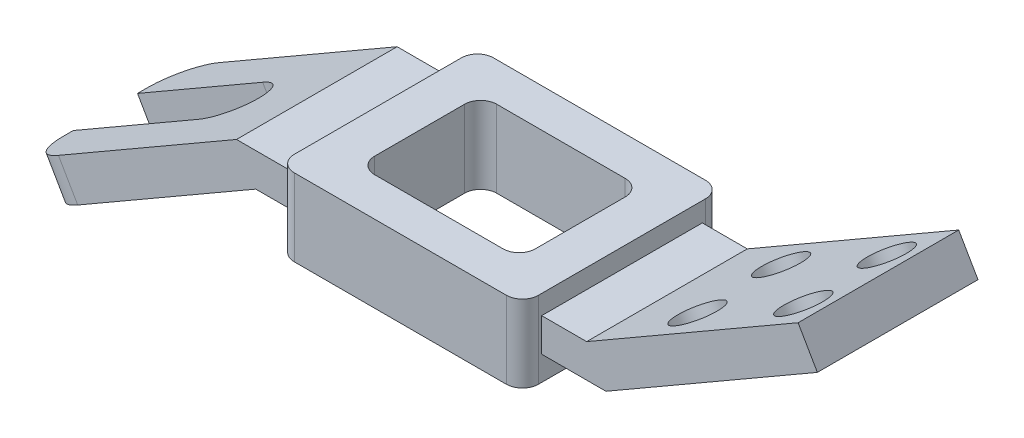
ISO-10303-21;
HEADER;
FILE_DESCRIPTION(('STEP AP214'),'2;1');
FILE_NAME('part.step','',(''),(''),'','','');
FILE_SCHEMA(('AUTOMOTIVE_DESIGN { 1 0 10303 214 1 1 1 1 }'));
ENDSEC;
DATA;
#1=APPLICATION_CONTEXT('core data for automotive mechanical design processes');
#2=APPLICATION_PROTOCOL_DEFINITION('international standard','automotive_design',2000,#1);
#3=PRODUCT_CONTEXT('',#1,'mechanical');
#4=PRODUCT('Part','Part','',(#3));
#5=PRODUCT_RELATED_PRODUCT_CATEGORY('part','',(#4));
#6=PRODUCT_DEFINITION_FORMATION('','',#4);
#7=PRODUCT_DEFINITION_CONTEXT('part definition',#1,'design');
#8=PRODUCT_DEFINITION('design','',#6,#7);
#9=PRODUCT_DEFINITION_SHAPE('','',#8);
#10=(LENGTH_UNIT() NAMED_UNIT(*) SI_UNIT(.MILLI.,.METRE.));
#11=(NAMED_UNIT(*) PLANE_ANGLE_UNIT() SI_UNIT($,.RADIAN.));
#12=(NAMED_UNIT(*) SI_UNIT($,.STERADIAN.) SOLID_ANGLE_UNIT());
#13=UNCERTAINTY_MEASURE_WITH_UNIT(LENGTH_MEASURE(1.E-05),#10,'distance_accuracy_value','');
#14=(GEOMETRIC_REPRESENTATION_CONTEXT(3) GLOBAL_UNCERTAINTY_ASSIGNED_CONTEXT((#13)) GLOBAL_UNIT_ASSIGNED_CONTEXT((#10,
#11,#12)) REPRESENTATION_CONTEXT('',''));
#15=CARTESIAN_POINT('',(0.,0.,0.));
#16=DIRECTION('',(0.,0.,1.));
#17=DIRECTION('',(1.,0.,0.));
#18=AXIS2_PLACEMENT_3D('',#15,#16,#17);
#19=CARTESIAN_POINT('',(-116.817930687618,-48.3923048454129,50.));
#20=DIRECTION('',(0.866025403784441,0.499999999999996,0.));
#21=DIRECTION('',(-0.499999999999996,0.866025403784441,0.));
#22=AXIS2_PLACEMENT_3D('',#19,#20,#21);
#23=PLANE('',#22);
#24=DIRECTION('',(0.,0.,-1.));
#25=VECTOR('',#24,1.);
#26=CARTESIAN_POINT('',(-116.817930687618,-48.3923048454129,50.));
#27=LINE('',#26,#25);
#28=CARTESIAN_POINT('',(-116.817930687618,-48.3923048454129,38.));
#29=VERTEX_POINT('',#28);
#30=CARTESIAN_POINT('',(-116.817930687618,-48.3923048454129,35.));
#31=VERTEX_POINT('',#30);
#32=EDGE_CURVE('E311',#29,#31,#27,.T.);
#33=ORIENTED_EDGE('',*,*,#32,.F.);
#34=DIRECTION('',(0.499999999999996,-0.866025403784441,0.));
#35=VECTOR('',#34,1.);
#36=CARTESIAN_POINT('',(-116.817930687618,-48.3923048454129,38.));
#37=LINE('',#36,#35);
#38=CARTESIAN_POINT('',(-122.817930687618,-37.9999999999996,38.));
#39=VERTEX_POINT('',#38);
#40=EDGE_CURVE('E333',#29,#39,#37,.F.);
#41=ORIENTED_EDGE('',*,*,#40,.T.);
#42=DIRECTION('',(0.,0.,-1.));
#43=VECTOR('',#42,1.);
#44=CARTESIAN_POINT('',(-122.817930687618,-37.9999999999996,50.));
#45=LINE('',#44,#43);
#46=CARTESIAN_POINT('',(-122.817930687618,-37.9999999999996,35.));
#47=VERTEX_POINT('',#46);
#48=EDGE_CURVE('E283',#39,#47,#45,.T.);
#49=ORIENTED_EDGE('',*,*,#48,.T.);
#50=DIRECTION('',(-0.499999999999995,0.866025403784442,0.));
#51=VECTOR('',#50,1.);
#52=CARTESIAN_POINT('',(-56.6589653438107,-152.590689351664,35.));
#53=LINE('',#52,#51);
#54=EDGE_CURVE('E277',#31,#47,#53,.T.);
#55=ORIENTED_EDGE('',*,*,#54,.F.);
#56=EDGE_LOOP('',(#33,#41,#49,#55));
#57=FACE_BOUND('',#56,.T.);
#58=ADVANCED_FACE('F33',(#57),#23,.F.);
#59=CARTESIAN_POINT('',(58.,-10.3923048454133,50.));
#60=DIRECTION('',(0.,1.,0.));
#61=DIRECTION('',(0.,0.,1.));
#62=AXIS2_PLACEMENT_3D('',#59,#60,#61);
#63=PLANE('',#62);
#64=DIRECTION('',(1.,0.,0.));
#65=VECTOR('',#64,1.);
#66=CARTESIAN_POINT('',(58.,-10.3923048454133,0.));
#67=LINE('',#66,#65);
#68=CARTESIAN_POINT('',(-51.0000000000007,-10.3923048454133,0.));
#69=VERTEX_POINT('',#68);
#70=CARTESIAN_POINT('',(-38.0000000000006,-10.3923048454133,0.));
#71=VERTEX_POINT('',#70);
#72=EDGE_CURVE('E498',#69,#71,#67,.T.);
#73=ORIENTED_EDGE('',*,*,#72,.T.);
#74=DIRECTION('',(0.,0.,1.));
#75=VECTOR('',#74,1.);
#76=CARTESIAN_POINT('',(-38.0000000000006,-10.3923048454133,50.));
#77=LINE('',#76,#75);
#78=CARTESIAN_POINT('',(-38.0000000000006,-10.3923048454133,50.));
#79=VERTEX_POINT('',#78);
#80=EDGE_CURVE('E476',#71,#79,#77,.T.);
#81=ORIENTED_EDGE('',*,*,#80,.T.);
#82=DIRECTION('',(1.,0.,0.));
#83=VECTOR('',#82,1.);
#84=CARTESIAN_POINT('',(-38.0000000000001,-10.3923048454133,50.));
#85=LINE('',#84,#83);
#86=CARTESIAN_POINT('',(-51.0000000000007,-10.3923048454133,50.));
#87=VERTEX_POINT('',#86);
#88=EDGE_CURVE('E484',#87,#79,#85,.T.);
#89=ORIENTED_EDGE('',*,*,#88,.F.);
#90=DIRECTION('',(0.,0.,-1.));
#91=VECTOR('',#90,1.);
#92=CARTESIAN_POINT('',(-51.0000000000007,-10.3923048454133,50.));
#93=LINE('',#92,#91);
#94=EDGE_CURVE('E308',#87,#69,#93,.T.);
#95=ORIENTED_EDGE('',*,*,#94,.T.);
#96=EDGE_LOOP('',(#73,#81,#89,#95));
#97=FACE_BOUND('',#96,.T.);
#98=ADVANCED_FACE('F572',(#97),#63,.F.);
#99=CARTESIAN_POINT('',(-57.0000000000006,0.,50.));
#100=DIRECTION('',(0.,-1.,0.));
#101=DIRECTION('',(1.,0.,0.));
#102=AXIS2_PLACEMENT_3D('',#99,#100,#101);
#103=PLANE('',#102);
#104=DIRECTION('',(-1.,0.,0.));
#105=VECTOR('',#104,1.);
#106=CARTESIAN_POINT('',(38.,0.,50.));
#107=LINE('',#106,#105);
#108=CARTESIAN_POINT('',(-38.0000000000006,0.,50.));
#109=VERTEX_POINT('',#108);
#110=CARTESIAN_POINT('',(-57.0000000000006,0.,50.));
#111=VERTEX_POINT('',#110);
#112=EDGE_CURVE('E493',#109,#111,#107,.T.);
#113=ORIENTED_EDGE('',*,*,#112,.F.);
#114=DIRECTION('',(0.,0.,-1.));
#115=VECTOR('',#114,1.);
#116=CARTESIAN_POINT('',(-38.0000000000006,0.,50.));
#117=LINE('',#116,#115);
#118=CARTESIAN_POINT('',(-38.0000000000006,0.,0.));
#119=VERTEX_POINT('',#118);
#120=EDGE_CURVE('E473',#109,#119,#117,.T.);
#121=ORIENTED_EDGE('',*,*,#120,.T.);
#122=DIRECTION('',(-1.,0.,0.));
#123=VECTOR('',#122,1.);
#124=CARTESIAN_POINT('',(-57.0000000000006,0.,0.));
#125=LINE('',#124,#123);
#126=CARTESIAN_POINT('',(-57.0000000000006,0.,0.));
#127=VERTEX_POINT('',#126);
#128=EDGE_CURVE('E507',#119,#127,#125,.T.);
#129=ORIENTED_EDGE('',*,*,#128,.T.);
#130=DIRECTION('',(0.,0.,-1.));
#131=VECTOR('',#130,1.);
#132=CARTESIAN_POINT('',(-57.0000000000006,0.,50.));
#133=LINE('',#132,#131);
#134=EDGE_CURVE('E286',#111,#127,#133,.T.);
#135=ORIENTED_EDGE('',*,*,#134,.F.);
#136=EDGE_LOOP('',(#113,#121,#129,#135));
#137=FACE_BOUND('',#136,.T.);
#138=ADVANCED_FACE('F515',(#137),#103,.F.);
#139=CARTESIAN_POINT('',(0.,0.,50.));
#140=DIRECTION('',(0.,0.,-1.));
#141=DIRECTION('',(-1.,0.,0.));
#142=AXIS2_PLACEMENT_3D('',#139,#140,#141);
#143=PLANE('',#142);
#144=DIRECTION('',(-0.866025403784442,-0.499999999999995,0.));
#145=VECTOR('',#144,1.);
#146=CARTESIAN_POINT('',(-122.817930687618,-37.9999999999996,50.));
#147=LINE('',#146,#145);
#148=CARTESIAN_POINT('',(-112.425625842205,-31.9999999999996,50.));
#149=VERTEX_POINT('',#148);
#150=EDGE_CURVE('E284',#111,#149,#147,.T.);
#151=ORIENTED_EDGE('',*,*,#150,.T.);
#152=DIRECTION('',(0.499999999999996,-0.866025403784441,0.));
#153=VECTOR('',#152,1.);
#154=CARTESIAN_POINT('',(-98.1756258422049,-56.6817240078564,50.));
#155=LINE('',#154,#153);
#156=CARTESIAN_POINT('',(-106.425625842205,-42.3923048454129,50.));
#157=VERTEX_POINT('',#156);
#158=EDGE_CURVE('E330',#149,#157,#155,.T.);
#159=ORIENTED_EDGE('',*,*,#158,.T.);
#160=DIRECTION('',(0.866025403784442,0.499999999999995,0.));
#161=VECTOR('',#160,1.);
#162=CARTESIAN_POINT('',(-51.0000000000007,-10.3923048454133,50.));
#163=LINE('',#162,#161);
#164=EDGE_CURVE('E481',#157,#87,#163,.T.);
#165=ORIENTED_EDGE('',*,*,#164,.T.);
#166=ORIENTED_EDGE('',*,*,#88,.T.);
#167=DIRECTION('',(0.,1.,0.));
#168=VECTOR('',#167,1.);
#169=CARTESIAN_POINT('',(-38.0000000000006,0.,50.));
#170=LINE('',#169,#168);
#171=EDGE_CURVE('E478',#79,#109,#170,.T.);
#172=ORIENTED_EDGE('',*,*,#171,.T.);
#173=ORIENTED_EDGE('',*,*,#112,.T.);
#174=EDGE_LOOP('',(#151,#159,#165,#166,#172,#173));
#175=FACE_BOUND('',#174,.T.);
#176=ADVANCED_FACE('F589',(#175),#143,.F.);
#177=CARTESIAN_POINT('',(0.,0.,0.));
#178=DIRECTION('',(0.,0.,-1.));
#179=DIRECTION('',(-1.,0.,0.));
#180=AXIS2_PLACEMENT_3D('',#177,#178,#179);
#181=PLANE('',#180);
#182=DIRECTION('',(0.866025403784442,0.499999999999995,0.));
#183=VECTOR('',#182,1.);
#184=CARTESIAN_POINT('',(-51.0000000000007,-10.3923048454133,0.));
#185=LINE('',#184,#183);
#186=CARTESIAN_POINT('',(-106.425625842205,-42.3923048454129,0.));
#187=VERTEX_POINT('',#186);
#188=EDGE_CURVE('E480',#187,#69,#185,.T.);
#189=ORIENTED_EDGE('',*,*,#188,.F.);
#190=DIRECTION('',(0.499999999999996,-0.866025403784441,0.));
#191=VECTOR('',#190,1.);
#192=CARTESIAN_POINT('',(-112.425625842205,-31.9999999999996,0.));
#193=LINE('',#192,#191);
#194=CARTESIAN_POINT('',(-112.425625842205,-31.9999999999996,0.));
#195=VERTEX_POINT('',#194);
#196=EDGE_CURVE('E325',#187,#195,#193,.F.);
#197=ORIENTED_EDGE('',*,*,#196,.T.);
#198=DIRECTION('',(-0.866025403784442,-0.499999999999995,0.));
#199=VECTOR('',#198,1.);
#200=CARTESIAN_POINT('',(-122.817930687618,-37.9999999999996,0.));
#201=LINE('',#200,#199);
#202=EDGE_CURVE('E292',#127,#195,#201,.T.);
#203=ORIENTED_EDGE('',*,*,#202,.F.);
#204=ORIENTED_EDGE('',*,*,#128,.F.);
#205=DIRECTION('',(0.,1.,0.));
#206=VECTOR('',#205,1.);
#207=CARTESIAN_POINT('',(-38.0000000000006,0.,0.));
#208=LINE('',#207,#206);
#209=EDGE_CURVE('E316',#71,#119,#208,.T.);
#210=ORIENTED_EDGE('',*,*,#209,.F.);
#211=ORIENTED_EDGE('',*,*,#72,.F.);
#212=EDGE_LOOP('',(#189,#197,#203,#204,#210,#211));
#213=FACE_BOUND('',#212,.T.);
#214=ADVANCED_FACE('F521',(#213),#181,.T.);
#215=CARTESIAN_POINT('',(-122.817930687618,-37.9999999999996,15.));
#216=VERTEX_POINT('',#215);
#217=CARTESIAN_POINT('',(-122.817930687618,-37.9999999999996,12.));
#218=VERTEX_POINT('',#217);
#219=EDGE_CURVE('E273',#216,#218,#45,.T.);
#220=ORIENTED_EDGE('',*,*,#219,.T.);
#221=DIRECTION('',(0.499999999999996,-0.866025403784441,0.));
#222=VECTOR('',#221,1.);
#223=CARTESIAN_POINT('',(-116.817930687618,-48.3923048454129,12.));
#224=LINE('',#223,#222);
#225=CARTESIAN_POINT('',(-116.817930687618,-48.3923048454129,12.));
#226=VERTEX_POINT('',#225);
#227=EDGE_CURVE('E319',#218,#226,#224,.T.);
#228=ORIENTED_EDGE('',*,*,#227,.T.);
#229=CARTESIAN_POINT('',(-116.817930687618,-48.3923048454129,15.));
#230=VERTEX_POINT('',#229);
#231=EDGE_CURVE('E276',#230,#226,#27,.T.);
#232=ORIENTED_EDGE('',*,*,#231,.F.);
#233=DIRECTION('',(-0.499999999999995,0.866025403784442,0.));
#234=VECTOR('',#233,1.);
#235=CARTESIAN_POINT('',(-56.6589653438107,-152.590689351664,15.));
#236=LINE('',#235,#234);
#237=EDGE_CURVE('E258',#230,#216,#236,.T.);
#238=ORIENTED_EDGE('',*,*,#237,.T.);
#239=EDGE_LOOP('',(#220,#228,#232,#238));
#240=FACE_BOUND('',#239,.T.);
#241=ADVANCED_FACE('F271',(#240),#23,.F.);
#242=CARTESIAN_POINT('',(-51.0000000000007,-10.3923048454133,50.));
#243=DIRECTION('',(-0.499999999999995,0.866025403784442,0.));
#244=DIRECTION('',(-0.866025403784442,-0.499999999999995,0.));
#245=AXIS2_PLACEMENT_3D('',#242,#243,#244);
#246=PLANE('',#245);
#247=ORIENTED_EDGE('',*,*,#231,.T.);
#248=CARTESIAN_POINT('',(-106.425625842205,-42.3923048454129,12.));
#249=DIRECTION('',(-0.499999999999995,0.866025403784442,0.));
#250=DIRECTION('',(-0.866025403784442,-0.499999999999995,0.));
#251=AXIS2_PLACEMENT_3D('',#248,#249,#250);
#252=CIRCLE('',#251,12.);
#253=EDGE_CURVE('E323',#226,#187,#252,.F.);
#254=ORIENTED_EDGE('',*,*,#253,.T.);
#255=ORIENTED_EDGE('',*,*,#188,.T.);
#256=ORIENTED_EDGE('',*,*,#94,.F.);
#257=ORIENTED_EDGE('',*,*,#164,.F.);
#258=CARTESIAN_POINT('',(-106.425625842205,-42.3923048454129,38.));
#259=DIRECTION('',(-0.499999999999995,0.866025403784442,0.));
#260=DIRECTION('',(-0.866025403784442,-0.499999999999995,0.));
#261=AXIS2_PLACEMENT_3D('',#258,#259,#260);
#262=CIRCLE('',#261,12.);
#263=EDGE_CURVE('E321',#157,#29,#262,.F.);
#264=ORIENTED_EDGE('',*,*,#263,.T.);
#265=ORIENTED_EDGE('',*,*,#32,.T.);
#266=DIRECTION('',(0.866025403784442,0.499999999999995,0.));
#267=VECTOR('',#266,1.);
#268=CARTESIAN_POINT('',(-51.0000000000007,-10.3923048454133,35.));
#269=LINE('',#268,#267);
#270=CARTESIAN_POINT('',(-77.8467875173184,-25.8923048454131,35.));
#271=VERTEX_POINT('',#270);
#272=EDGE_CURVE('E532',#31,#271,#269,.T.);
#273=ORIENTED_EDGE('',*,*,#272,.T.);
#274=CARTESIAN_POINT('',(-77.8467875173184,-25.8923048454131,25.));
#275=DIRECTION('',(-0.499999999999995,0.866025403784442,0.));
#276=DIRECTION('',(-0.866025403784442,-0.499999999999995,0.));
#277=AXIS2_PLACEMENT_3D('',#274,#275,#276);
#278=CIRCLE('',#277,9.99999999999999);
#279=CARTESIAN_POINT('',(-77.8467875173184,-25.8923048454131,15.));
#280=VERTEX_POINT('',#279);
#281=EDGE_CURVE('E531',#271,#280,#278,.T.);
#282=ORIENTED_EDGE('',*,*,#281,.T.);
#283=DIRECTION('',(-0.866025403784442,-0.499999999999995,0.));
#284=VECTOR('',#283,1.);
#285=CARTESIAN_POINT('',(-51.0000000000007,-10.3923048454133,15.));
#286=LINE('',#285,#284);
#287=EDGE_CURVE('E529',#280,#230,#286,.T.);
#288=ORIENTED_EDGE('',*,*,#287,.T.);
#289=EDGE_LOOP('',(#247,#254,#255,#256,#257,#264,#265,#273,#282,#288));
#290=FACE_BOUND('',#289,.T.);
#291=ADVANCED_FACE('F527',(#290),#246,.F.);
#292=CARTESIAN_POINT('',(-122.817930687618,-37.9999999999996,50.));
#293=DIRECTION('',(0.499999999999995,-0.866025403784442,0.));
#294=DIRECTION('',(0.866025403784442,0.499999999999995,0.));
#295=AXIS2_PLACEMENT_3D('',#292,#293,#294);
#296=PLANE('',#295);
#297=ORIENTED_EDGE('',*,*,#202,.T.);
#298=CARTESIAN_POINT('',(-112.425625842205,-31.9999999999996,12.));
#299=DIRECTION('',(0.499999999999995,-0.866025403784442,0.));
#300=DIRECTION('',(0.866025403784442,0.499999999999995,0.));
#301=AXIS2_PLACEMENT_3D('',#298,#299,#300);
#302=CIRCLE('',#301,12.);
#303=EDGE_CURVE('E282',#195,#218,#302,.F.);
#304=ORIENTED_EDGE('',*,*,#303,.T.);
#305=ORIENTED_EDGE('',*,*,#219,.F.);
#306=DIRECTION('',(-0.866025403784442,-0.499999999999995,0.));
#307=VECTOR('',#306,1.);
#308=CARTESIAN_POINT('',(-83.8467875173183,-15.4999999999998,15.));
#309=LINE('',#308,#307);
#310=CARTESIAN_POINT('',(-83.8467875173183,-15.4999999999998,15.));
#311=VERTEX_POINT('',#310);
#312=EDGE_CURVE('E255',#311,#216,#309,.T.);
#313=ORIENTED_EDGE('',*,*,#312,.F.);
#314=CARTESIAN_POINT('',(-83.8467875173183,-15.4999999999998,25.));
#315=DIRECTION('',(-0.499999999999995,0.866025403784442,0.));
#316=DIRECTION('',(-0.866025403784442,-0.499999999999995,0.));
#317=AXIS2_PLACEMENT_3D('',#314,#315,#316);
#318=CIRCLE('',#317,9.99999999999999);
#319=CARTESIAN_POINT('',(-83.8467875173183,-15.4999999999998,35.));
#320=VERTEX_POINT('',#319);
#321=EDGE_CURVE('E266',#320,#311,#318,.T.);
#322=ORIENTED_EDGE('',*,*,#321,.F.);
#323=DIRECTION('',(0.866025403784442,0.499999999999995,0.));
#324=VECTOR('',#323,1.);
#325=CARTESIAN_POINT('',(-83.8467875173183,-15.4999999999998,35.));
#326=LINE('',#325,#324);
#327=EDGE_CURVE('E265',#47,#320,#326,.T.);
#328=ORIENTED_EDGE('',*,*,#327,.F.);
#329=ORIENTED_EDGE('',*,*,#48,.F.);
#330=CARTESIAN_POINT('',(-112.425625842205,-31.9999999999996,38.));
#331=DIRECTION('',(0.499999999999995,-0.866025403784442,0.));
#332=DIRECTION('',(0.866025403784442,0.499999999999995,0.));
#333=AXIS2_PLACEMENT_3D('',#330,#331,#332);
#334=CIRCLE('',#333,12.);
#335=EDGE_CURVE('E327',#39,#149,#334,.F.);
#336=ORIENTED_EDGE('',*,*,#335,.T.);
#337=ORIENTED_EDGE('',*,*,#150,.F.);
#338=ORIENTED_EDGE('',*,*,#134,.T.);
#339=EDGE_LOOP('',(#297,#304,#305,#313,#322,#328,#329,#336,#337,#338));
#340=FACE_BOUND('',#339,.T.);
#341=ADVANCED_FACE('F280',(#340),#296,.F.);
#342=CARTESIAN_POINT('',(-38.0000000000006,-18.,-6.));
#343=DIRECTION('',(-1.,0.,0.));
#344=DIRECTION('',(0.,-1.,0.));
#345=AXIS2_PLACEMENT_3D('',#342,#343,#344);
#346=PLANE('',#345);
#347=DIRECTION('',(0.,0.,1.));
#348=VECTOR('',#347,1.);
#349=CARTESIAN_POINT('',(-38.0000000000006,6.00000000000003,-6.));
#350=LINE('',#349,#348);
#351=CARTESIAN_POINT('',(-38.0000000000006,6.00000000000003,-0.999999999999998));
#352=VERTEX_POINT('',#351);
#353=CARTESIAN_POINT('',(-38.0000000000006,6.00000000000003,51.));
#354=VERTEX_POINT('',#353);
#355=EDGE_CURVE('E443',#352,#354,#350,.T.);
#356=ORIENTED_EDGE('',*,*,#355,.F.);
#357=DIRECTION('',(0.,1.,0.));
#358=VECTOR('',#357,1.);
#359=CARTESIAN_POINT('',(-38.0000000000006,-18.,-0.999999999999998));
#360=LINE('',#359,#358);
#361=CARTESIAN_POINT('',(-38.0000000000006,-18.,-0.999999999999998));
#362=VERTEX_POINT('',#361);
#363=EDGE_CURVE('E383',#352,#362,#360,.F.);
#364=ORIENTED_EDGE('',*,*,#363,.T.);
#365=DIRECTION('',(0.,0.,1.));
#366=VECTOR('',#365,1.);
#367=CARTESIAN_POINT('',(-38.0000000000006,-18.,-6.));
#368=LINE('',#367,#366);
#369=CARTESIAN_POINT('',(-38.0000000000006,-18.,51.));
#370=VERTEX_POINT('',#369);
#371=EDGE_CURVE('E455',#362,#370,#368,.T.);
#372=ORIENTED_EDGE('',*,*,#371,.T.);
#373=DIRECTION('',(0.,1.,0.));
#374=VECTOR('',#373,1.);
#375=CARTESIAN_POINT('',(-38.0000000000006,-18.,51.));
#376=LINE('',#375,#374);
#377=EDGE_CURVE('E380',#370,#354,#376,.T.);
#378=ORIENTED_EDGE('',*,*,#377,.T.);
#379=EDGE_LOOP('',(#356,#364,#372,#378));
#380=FACE_BOUND('',#379,.T.);
#381=ORIENTED_EDGE('',*,*,#171,.F.);
#382=ORIENTED_EDGE('',*,*,#80,.F.);
#383=ORIENTED_EDGE('',*,*,#209,.T.);
#384=ORIENTED_EDGE('',*,*,#120,.F.);
#385=EDGE_LOOP('',(#381,#382,#383,#384));
#386=FACE_BOUND('',#385,.T.);
#387=ADVANCED_FACE('F645',(#380,#386),#346,.T.);
#388=CARTESIAN_POINT('',(37.9999999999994,-18.,-6.));
#389=DIRECTION('',(1.,0.,0.));
#390=DIRECTION('',(0.,1.,0.));
#391=AXIS2_PLACEMENT_3D('',#388,#389,#390);
#392=PLANE('',#391);
#393=DIRECTION('',(0.,0.,-1.));
#394=VECTOR('',#393,1.);
#395=CARTESIAN_POINT('',(37.9999999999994,-18.,-6.));
#396=LINE('',#395,#394);
#397=CARTESIAN_POINT('',(37.9999999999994,-18.,51.));
#398=VERTEX_POINT('',#397);
#399=CARTESIAN_POINT('',(37.9999999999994,-18.,-1.));
#400=VERTEX_POINT('',#399);
#401=EDGE_CURVE('E460',#398,#400,#396,.T.);
#402=ORIENTED_EDGE('',*,*,#401,.T.);
#403=DIRECTION('',(0.,1.,0.));
#404=VECTOR('',#403,1.);
#405=CARTESIAN_POINT('',(37.9999999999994,-18.,-1.));
#406=LINE('',#405,#404);
#407=CARTESIAN_POINT('',(37.9999999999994,5.99999999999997,-1.));
#408=VERTEX_POINT('',#407);
#409=EDGE_CURVE('E357',#400,#408,#406,.T.);
#410=ORIENTED_EDGE('',*,*,#409,.T.);
#411=DIRECTION('',(0.,0.,-1.));
#412=VECTOR('',#411,1.);
#413=CARTESIAN_POINT('',(37.9999999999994,5.99999999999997,-6.));
#414=LINE('',#413,#412);
#415=CARTESIAN_POINT('',(37.9999999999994,5.99999999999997,51.));
#416=VERTEX_POINT('',#415);
#417=EDGE_CURVE('E449',#416,#408,#414,.T.);
#418=ORIENTED_EDGE('',*,*,#417,.F.);
#419=DIRECTION('',(0.,1.,0.));
#420=VECTOR('',#419,1.);
#421=CARTESIAN_POINT('',(37.9999999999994,-18.,51.));
#422=LINE('',#421,#420);
#423=EDGE_CURVE('E355',#416,#398,#422,.F.);
#424=ORIENTED_EDGE('',*,*,#423,.T.);
#425=EDGE_LOOP('',(#402,#410,#418,#424));
#426=FACE_BOUND('',#425,.T.);
#427=DIRECTION('',(0.,-1.,0.));
#428=VECTOR('',#427,1.);
#429=CARTESIAN_POINT('',(37.9999999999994,0.,50.));
#430=LINE('',#429,#428);
#431=CARTESIAN_POINT('',(37.9999999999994,0.,50.));
#432=VERTEX_POINT('',#431);
#433=CARTESIAN_POINT('',(37.9999999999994,-10.3923048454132,50.));
#434=VERTEX_POINT('',#433);
#435=EDGE_CURVE('E471',#432,#434,#430,.T.);
#436=ORIENTED_EDGE('',*,*,#435,.F.);
#437=DIRECTION('',(0.,0.,1.));
#438=VECTOR('',#437,1.);
#439=CARTESIAN_POINT('',(37.9999999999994,0.,50.));
#440=LINE('',#439,#438);
#441=CARTESIAN_POINT('',(37.9999999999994,0.,0.));
#442=VERTEX_POINT('',#441);
#443=EDGE_CURVE('E466',#442,#432,#440,.T.);
#444=ORIENTED_EDGE('',*,*,#443,.F.);
#445=DIRECTION('',(0.,-1.,0.));
#446=VECTOR('',#445,1.);
#447=CARTESIAN_POINT('',(37.9999999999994,0.,0.));
#448=LINE('',#447,#446);
#449=CARTESIAN_POINT('',(37.9999999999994,-10.3923048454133,0.));
#450=VERTEX_POINT('',#449);
#451=EDGE_CURVE('E313',#442,#450,#448,.T.);
#452=ORIENTED_EDGE('',*,*,#451,.T.);
#453=DIRECTION('',(0.,0.,-1.));
#454=VECTOR('',#453,1.);
#455=CARTESIAN_POINT('',(37.9999999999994,-10.3923048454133,50.));
#456=LINE('',#455,#454);
#457=EDGE_CURVE('E468',#434,#450,#456,.T.);
#458=ORIENTED_EDGE('',*,*,#457,.F.);
#459=EDGE_LOOP('',(#436,#444,#452,#458));
#460=FACE_BOUND('',#459,.T.);
#461=ADVANCED_FACE('F614',(#426,#460),#392,.T.);
#462=CARTESIAN_POINT('',(-38.0000000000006,-18.,-6.));
#463=DIRECTION('',(0.,0.,-1.));
#464=DIRECTION('',(-1.,0.,0.));
#465=AXIS2_PLACEMENT_3D('',#462,#463,#464);
#466=PLANE('',#465);
#467=DIRECTION('',(-1.,0.,0.));
#468=VECTOR('',#467,1.);
#469=CARTESIAN_POINT('',(-38.0000000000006,6.00000000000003,-6.));
#470=LINE('',#469,#468);
#471=CARTESIAN_POINT('',(32.9999999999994,5.99999999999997,-6.));
#472=VERTEX_POINT('',#471);
#473=CARTESIAN_POINT('',(-33.0000000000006,6.00000000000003,-6.));
#474=VERTEX_POINT('',#473);
#475=EDGE_CURVE('E452',#472,#474,#470,.T.);
#476=ORIENTED_EDGE('',*,*,#475,.F.);
#477=DIRECTION('',(0.,1.,0.));
#478=VECTOR('',#477,1.);
#479=CARTESIAN_POINT('',(32.9999999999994,-18.,-6.));
#480=LINE('',#479,#478);
#481=CARTESIAN_POINT('',(32.9999999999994,-18.,-6.));
#482=VERTEX_POINT('',#481);
#483=EDGE_CURVE('E371',#472,#482,#480,.F.);
#484=ORIENTED_EDGE('',*,*,#483,.T.);
#485=DIRECTION('',(-1.,0.,0.));
#486=VECTOR('',#485,1.);
#487=CARTESIAN_POINT('',(-38.0000000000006,-18.,-6.));
#488=LINE('',#487,#486);
#489=CARTESIAN_POINT('',(-33.0000000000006,-18.,-6.));
#490=VERTEX_POINT('',#489);
#491=EDGE_CURVE('E463',#482,#490,#488,.T.);
#492=ORIENTED_EDGE('',*,*,#491,.T.);
#493=DIRECTION('',(0.,1.,0.));
#494=VECTOR('',#493,1.);
#495=CARTESIAN_POINT('',(-33.0000000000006,-18.,-6.));
#496=LINE('',#495,#494);
#497=EDGE_CURVE('E368',#490,#474,#496,.T.);
#498=ORIENTED_EDGE('',*,*,#497,.T.);
#499=EDGE_LOOP('',(#476,#484,#492,#498));
#500=FACE_BOUND('',#499,.T.);
#501=ADVANCED_FACE('F654',(#500),#466,.T.);
#502=CARTESIAN_POINT('',(-38.0000000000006,-18.,56.));
#503=DIRECTION('',(0.,0.,1.));
#504=DIRECTION('',(1.,0.,0.));
#505=AXIS2_PLACEMENT_3D('',#502,#503,#504);
#506=PLANE('',#505);
#507=DIRECTION('',(1.,0.,0.));
#508=VECTOR('',#507,1.);
#509=CARTESIAN_POINT('',(-38.0000000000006,-18.,56.));
#510=LINE('',#509,#508);
#511=CARTESIAN_POINT('',(-33.0000000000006,-18.,56.));
#512=VERTEX_POINT('',#511);
#513=CARTESIAN_POINT('',(32.9999999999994,-18.,56.));
#514=VERTEX_POINT('',#513);
#515=EDGE_CURVE('E458',#512,#514,#510,.T.);
#516=ORIENTED_EDGE('',*,*,#515,.T.);
#517=DIRECTION('',(0.,1.,0.));
#518=VECTOR('',#517,1.);
#519=CARTESIAN_POINT('',(32.9999999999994,-18.,56.));
#520=LINE('',#519,#518);
#521=CARTESIAN_POINT('',(32.9999999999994,5.99999999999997,56.));
#522=VERTEX_POINT('',#521);
#523=EDGE_CURVE('E386',#514,#522,#520,.T.);
#524=ORIENTED_EDGE('',*,*,#523,.T.);
#525=DIRECTION('',(1.,0.,0.));
#526=VECTOR('',#525,1.);
#527=CARTESIAN_POINT('',(-38.0000000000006,6.00000000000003,56.));
#528=LINE('',#527,#526);
#529=CARTESIAN_POINT('',(-33.0000000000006,6.00000000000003,56.));
#530=VERTEX_POINT('',#529);
#531=EDGE_CURVE('E446',#530,#522,#528,.T.);
#532=ORIENTED_EDGE('',*,*,#531,.F.);
#533=DIRECTION('',(0.,1.,0.));
#534=VECTOR('',#533,1.);
#535=CARTESIAN_POINT('',(-33.0000000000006,-18.,56.));
#536=LINE('',#535,#534);
#537=EDGE_CURVE('E55',#530,#512,#536,.F.);
#538=ORIENTED_EDGE('',*,*,#537,.T.);
#539=EDGE_LOOP('',(#516,#524,#532,#538));
#540=FACE_BOUND('',#539,.T.);
#541=ADVANCED_FACE('F660',(#540),#506,.T.);
#542=CARTESIAN_POINT('',(0.,-18.,0.));
#543=DIRECTION('',(0.,1.,0.));
#544=DIRECTION('',(-1.,0.,0.));
#545=AXIS2_PLACEMENT_3D('',#542,#543,#544);
#546=PLANE('',#545);
#547=DIRECTION('',(0.,0.,-1.));
#548=VECTOR('',#547,1.);
#549=CARTESIAN_POINT('',(24.9999999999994,-18.,0.));
#550=LINE('',#549,#548);
#551=CARTESIAN_POINT('',(24.9999999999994,-18.,39.));
#552=VERTEX_POINT('',#551);
#553=CARTESIAN_POINT('',(24.9999999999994,-18.,11.));
#554=VERTEX_POINT('',#553);
#555=EDGE_CURVE('E426',#552,#554,#550,.T.);
#556=ORIENTED_EDGE('',*,*,#555,.T.);
#557=CARTESIAN_POINT('',(19.9999999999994,-18.,11.));
#558=DIRECTION('',(0.,1.,0.));
#559=DIRECTION('',(-1.,0.,0.));
#560=AXIS2_PLACEMENT_3D('',#557,#558,#559);
#561=CIRCLE('',#560,5.);
#562=CARTESIAN_POINT('',(19.9999999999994,-18.,6.));
#563=VERTEX_POINT('',#562);
#564=EDGE_CURVE('E399',#554,#563,#561,.T.);
#565=ORIENTED_EDGE('',*,*,#564,.T.);
#566=DIRECTION('',(-1.,0.,0.));
#567=VECTOR('',#566,1.);
#568=CARTESIAN_POINT('',(0.,-18.,6.));
#569=LINE('',#568,#567);
#570=CARTESIAN_POINT('',(-20.0000000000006,-18.,6.));
#571=VERTEX_POINT('',#570);
#572=EDGE_CURVE('E432',#563,#571,#569,.T.);
#573=ORIENTED_EDGE('',*,*,#572,.T.);
#574=CARTESIAN_POINT('',(-20.0000000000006,-18.,11.));
#575=DIRECTION('',(0.,1.,0.));
#576=DIRECTION('',(-1.,0.,0.));
#577=AXIS2_PLACEMENT_3D('',#574,#575,#576);
#578=CIRCLE('',#577,5.);
#579=CARTESIAN_POINT('',(-25.0000000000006,-18.,11.));
#580=VERTEX_POINT('',#579);
#581=EDGE_CURVE('E391',#571,#580,#578,.T.);
#582=ORIENTED_EDGE('',*,*,#581,.T.);
#583=DIRECTION('',(0.,0.,1.));
#584=VECTOR('',#583,1.);
#585=CARTESIAN_POINT('',(-25.0000000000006,-18.,0.));
#586=LINE('',#585,#584);
#587=CARTESIAN_POINT('',(-25.0000000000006,-18.,39.));
#588=VERTEX_POINT('',#587);
#589=EDGE_CURVE('E435',#580,#588,#586,.T.);
#590=ORIENTED_EDGE('',*,*,#589,.T.);
#591=CARTESIAN_POINT('',(-20.0000000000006,-18.,39.));
#592=DIRECTION('',(0.,1.,0.));
#593=DIRECTION('',(-1.,0.,0.));
#594=AXIS2_PLACEMENT_3D('',#591,#592,#593);
#595=CIRCLE('',#594,5.);
#596=CARTESIAN_POINT('',(-20.0000000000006,-18.,44.));
#597=VERTEX_POINT('',#596);
#598=EDGE_CURVE('E395',#588,#597,#595,.T.);
#599=ORIENTED_EDGE('',*,*,#598,.T.);
#600=DIRECTION('',(1.,0.,0.));
#601=VECTOR('',#600,1.);
#602=CARTESIAN_POINT('',(0.,-18.,44.));
#603=LINE('',#602,#601);
#604=CARTESIAN_POINT('',(19.9999999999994,-18.,44.));
#605=VERTEX_POINT('',#604);
#606=EDGE_CURVE('E428',#597,#605,#603,.T.);
#607=ORIENTED_EDGE('',*,*,#606,.T.);
#608=CARTESIAN_POINT('',(19.9999999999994,-18.,39.));
#609=DIRECTION('',(0.,1.,0.));
#610=DIRECTION('',(-1.,0.,0.));
#611=AXIS2_PLACEMENT_3D('',#608,#609,#610);
#612=CIRCLE('',#611,5.);
#613=EDGE_CURVE('E11',#605,#552,#612,.T.);
#614=ORIENTED_EDGE('',*,*,#613,.T.);
#615=EDGE_LOOP('',(#556,#565,#573,#582,#590,#599,#607,#614));
#616=FACE_BOUND('',#615,.T.);
#617=ORIENTED_EDGE('',*,*,#491,.F.);
#618=CARTESIAN_POINT('',(32.9999999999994,-18.,-1.));
#619=DIRECTION('',(0.,1.,0.));
#620=DIRECTION('',(-1.,0.,0.));
#621=AXIS2_PLACEMENT_3D('',#618,#619,#620);
#622=CIRCLE('',#621,5.);
#623=EDGE_CURVE('E378',#482,#400,#622,.F.);
#624=ORIENTED_EDGE('',*,*,#623,.T.);
#625=ORIENTED_EDGE('',*,*,#401,.F.);
#626=CARTESIAN_POINT('',(32.9999999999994,-18.,51.));
#627=DIRECTION('',(0.,1.,0.));
#628=DIRECTION('',(-1.,0.,0.));
#629=AXIS2_PLACEMENT_3D('',#626,#627,#628);
#630=CIRCLE('',#629,5.);
#631=EDGE_CURVE('E48',#398,#514,#630,.F.);
#632=ORIENTED_EDGE('',*,*,#631,.T.);
#633=ORIENTED_EDGE('',*,*,#515,.F.);
#634=CARTESIAN_POINT('',(-33.0000000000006,-18.,51.));
#635=DIRECTION('',(0.,1.,0.));
#636=DIRECTION('',(-1.,0.,0.));
#637=AXIS2_PLACEMENT_3D('',#634,#635,#636);
#638=CIRCLE('',#637,5.);
#639=EDGE_CURVE('E373',#512,#370,#638,.F.);
#640=ORIENTED_EDGE('',*,*,#639,.T.);
#641=ORIENTED_EDGE('',*,*,#371,.F.);
#642=CARTESIAN_POINT('',(-33.0000000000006,-18.,-0.999999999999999));
#643=DIRECTION('',(0.,1.,0.));
#644=DIRECTION('',(-1.,0.,0.));
#645=AXIS2_PLACEMENT_3D('',#642,#643,#644);
#646=CIRCLE('',#645,5.);
#647=EDGE_CURVE('E376',#362,#490,#646,.F.);
#648=ORIENTED_EDGE('',*,*,#647,.T.);
#649=EDGE_LOOP('',(#617,#624,#625,#632,#633,#640,#641,#648));
#650=FACE_BOUND('',#649,.T.);
#651=ADVANCED_FACE('F425',(#616,#650),#546,.F.);
#652=CARTESIAN_POINT('',(0.,6.,0.));
#653=DIRECTION('',(0.,1.,0.));
#654=DIRECTION('',(-1.,0.,0.));
#655=AXIS2_PLACEMENT_3D('',#652,#653,#654);
#656=PLANE('',#655);
#657=DIRECTION('',(0.,0.,1.));
#658=VECTOR('',#657,1.);
#659=CARTESIAN_POINT('',(-25.0000000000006,6.00000000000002,6.));
#660=LINE('',#659,#658);
#661=CARTESIAN_POINT('',(-25.0000000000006,6.00000000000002,11.));
#662=VERTEX_POINT('',#661);
#663=CARTESIAN_POINT('',(-25.0000000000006,6.00000000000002,39.));
#664=VERTEX_POINT('',#663);
#665=EDGE_CURVE('E418',#662,#664,#660,.T.);
#666=ORIENTED_EDGE('',*,*,#665,.F.);
#667=CARTESIAN_POINT('',(-20.0000000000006,6.00000000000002,11.));
#668=DIRECTION('',(0.,1.,0.));
#669=DIRECTION('',(-1.,0.,0.));
#670=AXIS2_PLACEMENT_3D('',#667,#668,#669);
#671=CIRCLE('',#670,5.);
#672=CARTESIAN_POINT('',(-20.0000000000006,6.00000000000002,6.));
#673=VERTEX_POINT('',#672);
#674=EDGE_CURVE('E389',#662,#673,#671,.F.);
#675=ORIENTED_EDGE('',*,*,#674,.T.);
#676=DIRECTION('',(-1.,0.,0.));
#677=VECTOR('',#676,1.);
#678=CARTESIAN_POINT('',(-25.0000000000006,6.00000000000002,6.));
#679=LINE('',#678,#677);
#680=CARTESIAN_POINT('',(19.9999999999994,5.99999999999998,6.));
#681=VERTEX_POINT('',#680);
#682=EDGE_CURVE('E437',#681,#673,#679,.T.);
#683=ORIENTED_EDGE('',*,*,#682,.F.);
#684=CARTESIAN_POINT('',(19.9999999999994,5.99999999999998,11.));
#685=DIRECTION('',(0.,1.,0.));
#686=DIRECTION('',(-1.,0.,0.));
#687=AXIS2_PLACEMENT_3D('',#684,#685,#686);
#688=CIRCLE('',#687,5.);
#689=CARTESIAN_POINT('',(24.9999999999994,5.99999999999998,11.));
#690=VERTEX_POINT('',#689);
#691=EDGE_CURVE('E397',#681,#690,#688,.F.);
#692=ORIENTED_EDGE('',*,*,#691,.T.);
#693=DIRECTION('',(0.,0.,-1.));
#694=VECTOR('',#693,1.);
#695=CARTESIAN_POINT('',(24.9999999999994,5.99999999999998,6.));
#696=LINE('',#695,#694);
#697=CARTESIAN_POINT('',(24.9999999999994,5.99999999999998,39.));
#698=VERTEX_POINT('',#697);
#699=EDGE_CURVE('E409',#698,#690,#696,.T.);
#700=ORIENTED_EDGE('',*,*,#699,.F.);
#701=CARTESIAN_POINT('',(19.9999999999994,5.99999999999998,39.));
#702=DIRECTION('',(0.,1.,0.));
#703=DIRECTION('',(-1.,0.,0.));
#704=AXIS2_PLACEMENT_3D('',#701,#702,#703);
#705=CIRCLE('',#704,5.);
#706=CARTESIAN_POINT('',(19.9999999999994,5.99999999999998,44.));
#707=VERTEX_POINT('',#706);
#708=EDGE_CURVE('E41',#698,#707,#705,.F.);
#709=ORIENTED_EDGE('',*,*,#708,.T.);
#710=DIRECTION('',(1.,0.,0.));
#711=VECTOR('',#710,1.);
#712=CARTESIAN_POINT('',(-25.0000000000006,6.00000000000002,44.));
#713=LINE('',#712,#711);
#714=CARTESIAN_POINT('',(-20.0000000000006,6.00000000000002,44.));
#715=VERTEX_POINT('',#714);
#716=EDGE_CURVE('E407',#715,#707,#713,.T.);
#717=ORIENTED_EDGE('',*,*,#716,.F.);
#718=CARTESIAN_POINT('',(-20.0000000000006,6.00000000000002,39.));
#719=DIRECTION('',(0.,1.,0.));
#720=DIRECTION('',(-1.,0.,0.));
#721=AXIS2_PLACEMENT_3D('',#718,#719,#720);
#722=CIRCLE('',#721,5.);
#723=EDGE_CURVE('E393',#715,#664,#722,.F.);
#724=ORIENTED_EDGE('',*,*,#723,.T.);
#725=EDGE_LOOP('',(#666,#675,#683,#692,#700,#709,#717,#724));
#726=FACE_BOUND('',#725,.T.);
#727=ORIENTED_EDGE('',*,*,#417,.T.);
#728=CARTESIAN_POINT('',(32.9999999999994,5.99999999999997,-1.));
#729=DIRECTION('',(0.,1.,0.));
#730=DIRECTION('',(-1.,0.,0.));
#731=AXIS2_PLACEMENT_3D('',#728,#729,#730);
#732=CIRCLE('',#731,5.);
#733=EDGE_CURVE('E366',#408,#472,#732,.T.);
#734=ORIENTED_EDGE('',*,*,#733,.T.);
#735=ORIENTED_EDGE('',*,*,#475,.T.);
#736=CARTESIAN_POINT('',(-33.0000000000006,6.00000000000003,-0.999999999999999));
#737=DIRECTION('',(0.,1.,0.));
#738=DIRECTION('',(-1.,0.,0.));
#739=AXIS2_PLACEMENT_3D('',#736,#737,#738);
#740=CIRCLE('',#739,5.);
#741=EDGE_CURVE('E364',#474,#352,#740,.T.);
#742=ORIENTED_EDGE('',*,*,#741,.T.);
#743=ORIENTED_EDGE('',*,*,#355,.T.);
#744=CARTESIAN_POINT('',(-33.0000000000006,6.00000000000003,51.));
#745=DIRECTION('',(0.,1.,0.));
#746=DIRECTION('',(-1.,0.,0.));
#747=AXIS2_PLACEMENT_3D('',#744,#745,#746);
#748=CIRCLE('',#747,5.);
#749=EDGE_CURVE('E360',#354,#530,#748,.T.);
#750=ORIENTED_EDGE('',*,*,#749,.T.);
#751=ORIENTED_EDGE('',*,*,#531,.T.);
#752=CARTESIAN_POINT('',(32.9999999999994,5.99999999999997,51.));
#753=DIRECTION('',(0.,1.,0.));
#754=DIRECTION('',(-1.,0.,0.));
#755=AXIS2_PLACEMENT_3D('',#752,#753,#754);
#756=CIRCLE('',#755,5.);
#757=EDGE_CURVE('E362',#522,#416,#756,.T.);
#758=ORIENTED_EDGE('',*,*,#757,.T.);
#759=EDGE_LOOP('',(#727,#734,#735,#742,#743,#750,#751,#758));
#760=FACE_BOUND('',#759,.T.);
#761=ADVANCED_FACE('F405',(#726,#760),#656,.T.);
#762=CARTESIAN_POINT('',(123.817930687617,27.6076951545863,50.));
#763=DIRECTION('',(-0.499999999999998,0.86602540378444,0.));
#764=DIRECTION('',(-0.86602540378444,-0.499999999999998,0.));
#765=AXIS2_PLACEMENT_3D('',#762,#763,#764);
#766=PLANE('',#765);
#767=CARTESIAN_POINT('',(80.516660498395,2.60769515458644,12.0000000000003));
#768=DIRECTION('',(-0.499999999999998,0.86602540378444,0.));
#769=DIRECTION('',(-0.86602540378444,-0.499999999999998,0.));
#770=AXIS2_PLACEMENT_3D('',#767,#768,#769);
#771=CIRCLE('',#770,7.00000000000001);
#772=CARTESIAN_POINT('',(74.4544826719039,-0.892304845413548,12.0000000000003));
#773=VERTEX_POINT('',#772);
#774=EDGE_CURVE('E715',#773,#773,#771,.T.);
#775=ORIENTED_EDGE('',*,*,#774,.T.);
#776=EDGE_LOOP('',(#775));
#777=FACE_BOUND('',#776,.T.);
#778=CARTESIAN_POINT('',(80.5166604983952,2.60769515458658,38.0000000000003));
#779=DIRECTION('',(-0.499999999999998,0.86602540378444,0.));
#780=DIRECTION('',(-0.86602540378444,-0.499999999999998,0.));
#781=AXIS2_PLACEMENT_3D('',#778,#779,#780);
#782=CIRCLE('',#781,7.);
#783=CARTESIAN_POINT('',(74.4544826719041,-0.892304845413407,38.0000000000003));
#784=VERTEX_POINT('',#783);
#785=EDGE_CURVE('E711',#784,#784,#782,.T.);
#786=ORIENTED_EDGE('',*,*,#785,.T.);
#787=EDGE_LOOP('',(#786));
#788=FACE_BOUND('',#787,.T.);
#789=CARTESIAN_POINT('',(113.425625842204,21.6076951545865,38.));
#790=DIRECTION('',(-0.499999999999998,0.86602540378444,0.));
#791=DIRECTION('',(-0.86602540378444,-0.499999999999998,0.));
#792=AXIS2_PLACEMENT_3D('',#789,#790,#791);
#793=CIRCLE('',#792,7.);
#794=CARTESIAN_POINT('',(107.363448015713,18.1076951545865,38.));
#795=VERTEX_POINT('',#794);
#796=EDGE_CURVE('E709',#795,#795,#793,.T.);
#797=ORIENTED_EDGE('',*,*,#796,.T.);
#798=EDGE_LOOP('',(#797));
#799=FACE_BOUND('',#798,.T.);
#800=CARTESIAN_POINT('',(113.425625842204,21.6076951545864,12.));
#801=DIRECTION('',(-0.499999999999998,0.86602540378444,0.));
#802=DIRECTION('',(-0.86602540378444,-0.499999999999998,0.));
#803=AXIS2_PLACEMENT_3D('',#800,#801,#802);
#804=CIRCLE('',#803,7.);
#805=CARTESIAN_POINT('',(107.363448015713,18.1076951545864,12.));
#806=VERTEX_POINT('',#805);
#807=EDGE_CURVE('E712',#806,#806,#804,.T.);
#808=ORIENTED_EDGE('',*,*,#807,.T.);
#809=EDGE_LOOP('',(#808));
#810=FACE_BOUND('',#809,.T.);
#811=DIRECTION('',(0.86602540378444,0.499999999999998,0.));
#812=VECTOR('',#811,1.);
#813=CARTESIAN_POINT('',(123.817930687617,27.6076951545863,0.));
#814=LINE('',#813,#812);
#815=CARTESIAN_POINT('',(58.,-10.3923048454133,0.));
#816=VERTEX_POINT('',#815);
#817=CARTESIAN_POINT('',(123.817930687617,27.6076951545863,0.));
#818=VERTEX_POINT('',#817);
#819=EDGE_CURVE('E501',#816,#818,#814,.T.);
#820=ORIENTED_EDGE('',*,*,#819,.T.);
#821=DIRECTION('',(0.,0.,-1.));
#822=VECTOR('',#821,1.);
#823=CARTESIAN_POINT('',(123.817930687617,27.6076951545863,50.));
#824=LINE('',#823,#822);
#825=CARTESIAN_POINT('',(123.817930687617,27.6076951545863,50.));
#826=VERTEX_POINT('',#825);
#827=EDGE_CURVE('E302',#826,#818,#824,.T.);
#828=ORIENTED_EDGE('',*,*,#827,.F.);
#829=DIRECTION('',(0.86602540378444,0.499999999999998,0.));
#830=VECTOR('',#829,1.);
#831=CARTESIAN_POINT('',(123.817930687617,27.6076951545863,50.));
#832=LINE('',#831,#830);
#833=CARTESIAN_POINT('',(58.,-10.3923048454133,50.));
#834=VERTEX_POINT('',#833);
#835=EDGE_CURVE('E487',#834,#826,#832,.T.);
#836=ORIENTED_EDGE('',*,*,#835,.F.);
#837=DIRECTION('',(0.,0.,-1.));
#838=VECTOR('',#837,1.);
#839=CARTESIAN_POINT('',(58.,-10.3923048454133,50.));
#840=LINE('',#839,#838);
#841=EDGE_CURVE('E305',#834,#816,#840,.T.);
#842=ORIENTED_EDGE('',*,*,#841,.T.);
#843=EDGE_LOOP('',(#820,#828,#836,#842));
#844=FACE_BOUND('',#843,.T.);
#845=ADVANCED_FACE('F628',(#777,#788,#799,#810,#844),#766,.F.);
#846=CARTESIAN_POINT('',(117.817930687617,37.9999999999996,50.));
#847=DIRECTION('',(-0.866025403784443,-0.499999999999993,0.));
#848=DIRECTION('',(0.499999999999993,-0.866025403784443,0.));
#849=AXIS2_PLACEMENT_3D('',#846,#847,#848);
#850=PLANE('',#849);
#851=DIRECTION('',(-0.499999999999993,0.866025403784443,0.));
#852=VECTOR('',#851,1.);
#853=CARTESIAN_POINT('',(117.817930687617,37.9999999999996,0.));
#854=LINE('',#853,#852);
#855=CARTESIAN_POINT('',(117.817930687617,37.9999999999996,0.));
#856=VERTEX_POINT('',#855);
#857=EDGE_CURVE('E503',#818,#856,#854,.T.);
#858=ORIENTED_EDGE('',*,*,#857,.T.);
#859=DIRECTION('',(0.,0.,-1.));
#860=VECTOR('',#859,1.);
#861=CARTESIAN_POINT('',(117.817930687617,37.9999999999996,50.));
#862=LINE('',#861,#860);
#863=CARTESIAN_POINT('',(117.817930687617,37.9999999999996,50.));
#864=VERTEX_POINT('',#863);
#865=EDGE_CURVE('E299',#864,#856,#862,.T.);
#866=ORIENTED_EDGE('',*,*,#865,.F.);
#867=DIRECTION('',(-0.499999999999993,0.866025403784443,0.));
#868=VECTOR('',#867,1.);
#869=CARTESIAN_POINT('',(117.817930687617,37.9999999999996,50.));
#870=LINE('',#869,#868);
#871=EDGE_CURVE('E489',#826,#864,#870,.T.);
#872=ORIENTED_EDGE('',*,*,#871,.F.);
#873=ORIENTED_EDGE('',*,*,#827,.T.);
#874=EDGE_LOOP('',(#858,#866,#872,#873));
#875=FACE_BOUND('',#874,.T.);
#876=ADVANCED_FACE('F624',(#875),#850,.F.);
#877=CARTESIAN_POINT('',(51.9999999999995,0.,50.));
#878=DIRECTION('',(0.499999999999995,-0.866025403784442,0.));
#879=DIRECTION('',(0.866025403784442,0.499999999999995,0.));
#880=AXIS2_PLACEMENT_3D('',#877,#878,#879);
#881=PLANE('',#880);
#882=CARTESIAN_POINT('',(74.516660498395,12.9999999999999,12.0000000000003));
#883=DIRECTION('',(-0.499999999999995,0.866025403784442,0.));
#884=DIRECTION('',(-0.866025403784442,-0.499999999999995,0.));
#885=AXIS2_PLACEMENT_3D('',#882,#883,#884);
#886=CIRCLE('',#885,7.00000000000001);
#887=CARTESIAN_POINT('',(68.4544826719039,9.49999999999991,12.0000000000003));
#888=VERTEX_POINT('',#887);
#889=EDGE_CURVE('E1043',#888,#888,#886,.T.);
#890=ORIENTED_EDGE('',*,*,#889,.F.);
#891=EDGE_LOOP('',(#890));
#892=FACE_BOUND('',#891,.T.);
#893=CARTESIAN_POINT('',(74.5166604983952,13.,38.0000000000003));
#894=DIRECTION('',(-0.499999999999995,0.866025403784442,0.));
#895=DIRECTION('',(-0.866025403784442,-0.499999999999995,0.));
#896=AXIS2_PLACEMENT_3D('',#893,#894,#895);
#897=CIRCLE('',#896,7.);
#898=CARTESIAN_POINT('',(68.4544826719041,9.50000000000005,38.0000000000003));
#899=VERTEX_POINT('',#898);
#900=EDGE_CURVE('E1044',#899,#899,#897,.T.);
#901=ORIENTED_EDGE('',*,*,#900,.F.);
#902=EDGE_LOOP('',(#901));
#903=FACE_BOUND('',#902,.T.);
#904=CARTESIAN_POINT('',(107.425625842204,31.9999999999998,38.));
#905=DIRECTION('',(-0.499999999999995,0.866025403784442,0.));
#906=DIRECTION('',(-0.866025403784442,-0.499999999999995,0.));
#907=AXIS2_PLACEMENT_3D('',#904,#905,#906);
#908=CIRCLE('',#907,7.);
#909=CARTESIAN_POINT('',(101.363448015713,28.4999999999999,38.));
#910=VERTEX_POINT('',#909);
#911=EDGE_CURVE('E706',#910,#910,#908,.T.);
#912=ORIENTED_EDGE('',*,*,#911,.F.);
#913=EDGE_LOOP('',(#912));
#914=FACE_BOUND('',#913,.T.);
#915=CARTESIAN_POINT('',(107.425625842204,31.9999999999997,12.));
#916=DIRECTION('',(-0.499999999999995,0.866025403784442,0.));
#917=DIRECTION('',(-0.866025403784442,-0.499999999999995,0.));
#918=AXIS2_PLACEMENT_3D('',#915,#916,#917);
#919=CIRCLE('',#918,7.);
#920=CARTESIAN_POINT('',(101.363448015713,28.4999999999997,12.));
#921=VERTEX_POINT('',#920);
#922=EDGE_CURVE('E718',#921,#921,#919,.T.);
#923=ORIENTED_EDGE('',*,*,#922,.F.);
#924=EDGE_LOOP('',(#923));
#925=FACE_BOUND('',#924,.T.);
#926=DIRECTION('',(-0.866025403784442,-0.499999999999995,0.));
#927=VECTOR('',#926,1.);
#928=CARTESIAN_POINT('',(51.9999999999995,0.,0.));
#929=LINE('',#928,#927);
#930=CARTESIAN_POINT('',(51.9999999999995,0.,0.));
#931=VERTEX_POINT('',#930);
#932=EDGE_CURVE('E505',#856,#931,#929,.T.);
#933=ORIENTED_EDGE('',*,*,#932,.T.);
#934=DIRECTION('',(0.,0.,-1.));
#935=VECTOR('',#934,1.);
#936=CARTESIAN_POINT('',(51.9999999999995,0.,50.));
#937=LINE('',#936,#935);
#938=CARTESIAN_POINT('',(51.9999999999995,0.,50.));
#939=VERTEX_POINT('',#938);
#940=EDGE_CURVE('E296',#939,#931,#937,.T.);
#941=ORIENTED_EDGE('',*,*,#940,.F.);
#942=DIRECTION('',(-0.866025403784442,-0.499999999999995,0.));
#943=VECTOR('',#942,1.);
#944=CARTESIAN_POINT('',(51.9999999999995,0.,50.));
#945=LINE('',#944,#943);
#946=EDGE_CURVE('E491',#864,#939,#945,.T.);
#947=ORIENTED_EDGE('',*,*,#946,.F.);
#948=ORIENTED_EDGE('',*,*,#865,.T.);
#949=EDGE_LOOP('',(#933,#941,#947,#948));
#950=FACE_BOUND('',#949,.T.);
#951=ADVANCED_FACE('F607',(#892,#903,#914,#925,#950),#881,.F.);
#952=EDGE_CURVE('E288',#939,#432,#107,.T.);
#953=ORIENTED_EDGE('',*,*,#952,.T.);
#954=ORIENTED_EDGE('',*,*,#435,.T.);
#955=EDGE_CURVE('E483',#434,#834,#85,.T.);
#956=ORIENTED_EDGE('',*,*,#955,.T.);
#957=ORIENTED_EDGE('',*,*,#835,.T.);
#958=ORIENTED_EDGE('',*,*,#871,.T.);
#959=ORIENTED_EDGE('',*,*,#946,.T.);
#960=EDGE_LOOP('',(#953,#954,#956,#957,#958,#959));
#961=FACE_BOUND('',#960,.T.);
#962=ADVANCED_FACE('F597',(#961),#143,.F.);
#963=ORIENTED_EDGE('',*,*,#451,.F.);
#964=EDGE_CURVE('E508',#931,#442,#125,.T.);
#965=ORIENTED_EDGE('',*,*,#964,.F.);
#966=ORIENTED_EDGE('',*,*,#932,.F.);
#967=ORIENTED_EDGE('',*,*,#857,.F.);
#968=ORIENTED_EDGE('',*,*,#819,.F.);
#969=EDGE_CURVE('E497',#450,#816,#67,.T.);
#970=ORIENTED_EDGE('',*,*,#969,.F.);
#971=EDGE_LOOP('',(#963,#965,#966,#967,#968,#970));
#972=FACE_BOUND('',#971,.T.);
#973=ADVANCED_FACE('F591',(#972),#181,.T.);
#974=ORIENTED_EDGE('',*,*,#964,.T.);
#975=ORIENTED_EDGE('',*,*,#443,.T.);
#976=ORIENTED_EDGE('',*,*,#952,.F.);
#977=ORIENTED_EDGE('',*,*,#940,.T.);
#978=EDGE_LOOP('',(#974,#975,#976,#977));
#979=FACE_BOUND('',#978,.T.);
#980=ADVANCED_FACE('F600',(#979),#103,.F.);
#981=ORIENTED_EDGE('',*,*,#955,.F.);
#982=ORIENTED_EDGE('',*,*,#457,.T.);
#983=ORIENTED_EDGE('',*,*,#969,.T.);
#984=ORIENTED_EDGE('',*,*,#841,.F.);
#985=EDGE_LOOP('',(#981,#982,#983,#984));
#986=FACE_BOUND('',#985,.T.);
#987=ADVANCED_FACE('F580',(#986),#63,.F.);
#988=CARTESIAN_POINT('',(-25.0000000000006,-48.392304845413,6.));
#989=DIRECTION('',(-1.,0.,0.));
#990=DIRECTION('',(0.,-1.,0.));
#991=AXIS2_PLACEMENT_3D('',#988,#989,#990);
#992=PLANE('',#991);
#993=ORIENTED_EDGE('',*,*,#589,.F.);
#994=DIRECTION('',(0.,1.,0.));
#995=VECTOR('',#994,1.);
#996=CARTESIAN_POINT('',(-25.0000000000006,6.00000000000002,11.));
#997=LINE('',#996,#995);
#998=EDGE_CURVE('E337',#580,#662,#997,.T.);
#999=ORIENTED_EDGE('',*,*,#998,.T.);
#1000=ORIENTED_EDGE('',*,*,#665,.T.);
#1001=DIRECTION('',(0.,1.,0.));
#1002=VECTOR('',#1001,1.);
#1003=CARTESIAN_POINT('',(-25.0000000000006,-18.,39.));
#1004=LINE('',#1003,#1002);
#1005=EDGE_CURVE('E335',#664,#588,#1004,.F.);
#1006=ORIENTED_EDGE('',*,*,#1005,.T.);
#1007=EDGE_LOOP('',(#993,#999,#1000,#1006));
#1008=FACE_BOUND('',#1007,.T.);
#1009=ADVANCED_FACE('F556',(#1008),#992,.F.);
#1010=CARTESIAN_POINT('',(-25.0000000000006,-48.392304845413,6.));
#1011=DIRECTION('',(0.,0.,-1.));
#1012=DIRECTION('',(-1.,0.,0.));
#1013=AXIS2_PLACEMENT_3D('',#1010,#1011,#1012);
#1014=PLANE('',#1013);
#1015=ORIENTED_EDGE('',*,*,#682,.T.);
#1016=DIRECTION('',(0.,1.,0.));
#1017=VECTOR('',#1016,1.);
#1018=CARTESIAN_POINT('',(-20.0000000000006,-18.,6.));
#1019=LINE('',#1018,#1017);
#1020=EDGE_CURVE('E343',#673,#571,#1019,.F.);
#1021=ORIENTED_EDGE('',*,*,#1020,.T.);
#1022=ORIENTED_EDGE('',*,*,#572,.F.);
#1023=DIRECTION('',(0.,1.,0.));
#1024=VECTOR('',#1023,1.);
#1025=CARTESIAN_POINT('',(19.9999999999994,5.99999999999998,6.));
#1026=LINE('',#1025,#1024);
#1027=EDGE_CURVE('E340',#563,#681,#1026,.T.);
#1028=ORIENTED_EDGE('',*,*,#1027,.T.);
#1029=EDGE_LOOP('',(#1015,#1021,#1022,#1028));
#1030=FACE_BOUND('',#1029,.T.);
#1031=ADVANCED_FACE('F546',(#1030),#1014,.F.);
#1032=CARTESIAN_POINT('',(24.9999999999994,-48.392304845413,6.));
#1033=DIRECTION('',(1.,0.,0.));
#1034=DIRECTION('',(0.,1.,0.));
#1035=AXIS2_PLACEMENT_3D('',#1032,#1033,#1034);
#1036=PLANE('',#1035);
#1037=ORIENTED_EDGE('',*,*,#699,.T.);
#1038=DIRECTION('',(0.,1.,0.));
#1039=VECTOR('',#1038,1.);
#1040=CARTESIAN_POINT('',(24.9999999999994,-18.,11.));
#1041=LINE('',#1040,#1039);
#1042=EDGE_CURVE('E353',#690,#554,#1041,.F.);
#1043=ORIENTED_EDGE('',*,*,#1042,.T.);
#1044=ORIENTED_EDGE('',*,*,#555,.F.);
#1045=DIRECTION('',(0.,1.,0.));
#1046=VECTOR('',#1045,1.);
#1047=CARTESIAN_POINT('',(24.9999999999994,5.99999999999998,39.));
#1048=LINE('',#1047,#1046);
#1049=EDGE_CURVE('E350',#552,#698,#1048,.T.);
#1050=ORIENTED_EDGE('',*,*,#1049,.T.);
#1051=EDGE_LOOP('',(#1037,#1043,#1044,#1050));
#1052=FACE_BOUND('',#1051,.T.);
#1053=ADVANCED_FACE('F430',(#1052),#1036,.F.);
#1054=CARTESIAN_POINT('',(-25.0000000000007,-48.392304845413,44.));
#1055=DIRECTION('',(0.,0.,1.));
#1056=DIRECTION('',(1.,0.,0.));
#1057=AXIS2_PLACEMENT_3D('',#1054,#1055,#1056);
#1058=PLANE('',#1057);
#1059=ORIENTED_EDGE('',*,*,#606,.F.);
#1060=DIRECTION('',(0.,1.,0.));
#1061=VECTOR('',#1060,1.);
#1062=CARTESIAN_POINT('',(-20.0000000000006,6.00000000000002,44.));
#1063=LINE('',#1062,#1061);
#1064=EDGE_CURVE('E347',#597,#715,#1063,.T.);
#1065=ORIENTED_EDGE('',*,*,#1064,.T.);
#1066=ORIENTED_EDGE('',*,*,#716,.T.);
#1067=DIRECTION('',(0.,1.,0.));
#1068=VECTOR('',#1067,1.);
#1069=CARTESIAN_POINT('',(19.9999999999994,-18.,44.));
#1070=LINE('',#1069,#1068);
#1071=EDGE_CURVE('E345',#707,#605,#1070,.F.);
#1072=ORIENTED_EDGE('',*,*,#1071,.T.);
#1073=EDGE_LOOP('',(#1059,#1065,#1066,#1072));
#1074=FACE_BOUND('',#1073,.T.);
#1075=ADVANCED_FACE('F415',(#1074),#1058,.F.);
#1076=CARTESIAN_POINT('',(-17.6878221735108,-130.090689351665,25.));
#1077=DIRECTION('',(-0.499999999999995,0.866025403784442,0.));
#1078=DIRECTION('',(-0.866025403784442,-0.499999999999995,0.));
#1079=AXIS2_PLACEMENT_3D('',#1076,#1077,#1078);
#1080=CYLINDRICAL_SURFACE('',#1079,9.99999999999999);
#1081=DIRECTION('',(-0.499999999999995,0.866025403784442,0.));
#1082=VECTOR('',#1081,1.);
#1083=CARTESIAN_POINT('',(-17.6878221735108,-130.090689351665,35.));
#1084=LINE('',#1083,#1082);
#1085=EDGE_CURVE('E533',#271,#320,#1084,.T.);
#1086=ORIENTED_EDGE('',*,*,#1085,.T.);
#1087=ORIENTED_EDGE('',*,*,#321,.T.);
#1088=DIRECTION('',(-0.499999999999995,0.866025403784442,0.));
#1089=VECTOR('',#1088,1.);
#1090=CARTESIAN_POINT('',(-17.6878221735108,-130.090689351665,15.));
#1091=LINE('',#1090,#1089);
#1092=EDGE_CURVE('E261',#280,#311,#1091,.T.);
#1093=ORIENTED_EDGE('',*,*,#1092,.F.);
#1094=ORIENTED_EDGE('',*,*,#281,.F.);
#1095=EDGE_LOOP('',(#1086,#1087,#1093,#1094));
#1096=FACE_BOUND('',#1095,.T.);
#1097=ADVANCED_FACE('F672',(#1096),#1080,.F.);
#1098=CARTESIAN_POINT('',(-17.6878221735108,-130.090689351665,35.));
#1099=DIRECTION('',(0.,0.,1.));
#1100=DIRECTION('',(1.,0.,0.));
#1101=AXIS2_PLACEMENT_3D('',#1098,#1099,#1100);
#1102=PLANE('',#1101);
#1103=ORIENTED_EDGE('',*,*,#54,.T.);
#1104=ORIENTED_EDGE('',*,*,#327,.T.);
#1105=ORIENTED_EDGE('',*,*,#1085,.F.);
#1106=ORIENTED_EDGE('',*,*,#272,.F.);
#1107=EDGE_LOOP('',(#1103,#1104,#1105,#1106));
#1108=FACE_BOUND('',#1107,.T.);
#1109=ADVANCED_FACE('F679',(#1108),#1102,.F.);
#1110=CARTESIAN_POINT('',(-17.6878221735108,-130.090689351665,15.));
#1111=DIRECTION('',(0.,0.,-1.));
#1112=DIRECTION('',(-1.,0.,0.));
#1113=AXIS2_PLACEMENT_3D('',#1110,#1111,#1112);
#1114=PLANE('',#1113);
#1115=ORIENTED_EDGE('',*,*,#1092,.T.);
#1116=ORIENTED_EDGE('',*,*,#312,.T.);
#1117=ORIENTED_EDGE('',*,*,#237,.F.);
#1118=ORIENTED_EDGE('',*,*,#287,.F.);
#1119=EDGE_LOOP('',(#1115,#1116,#1117,#1118));
#1120=FACE_BOUND('',#1119,.T.);
#1121=ADVANCED_FACE('F257',(#1120),#1114,.F.);
#1122=CARTESIAN_POINT('',(146.334591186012,-35.3923048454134,12.));
#1123=DIRECTION('',(-0.499999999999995,0.866025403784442,0.));
#1124=DIRECTION('',(-0.866025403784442,-0.499999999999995,0.));
#1125=AXIS2_PLACEMENT_3D('',#1122,#1123,#1124);
#1126=CYLINDRICAL_SURFACE('',#1125,7.);
#1127=ORIENTED_EDGE('',*,*,#922,.T.);
#1128=EDGE_LOOP('',(#1127));
#1129=FACE_BOUND('',#1128,.T.);
#1130=ORIENTED_EDGE('',*,*,#807,.F.);
#1131=EDGE_LOOP('',(#1130));
#1132=FACE_BOUND('',#1131,.T.);
#1133=ADVANCED_FACE('F683',(#1129,#1132),#1126,.F.);
#1134=CARTESIAN_POINT('',(146.334591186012,-35.3923048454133,38.));
#1135=DIRECTION('',(-0.499999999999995,0.866025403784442,0.));
#1136=DIRECTION('',(-0.866025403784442,-0.499999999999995,0.));
#1137=AXIS2_PLACEMENT_3D('',#1134,#1135,#1136);
#1138=CYLINDRICAL_SURFACE('',#1137,7.);
#1139=ORIENTED_EDGE('',*,*,#911,.T.);
#1140=EDGE_LOOP('',(#1139));
#1141=FACE_BOUND('',#1140,.T.);
#1142=ORIENTED_EDGE('',*,*,#796,.F.);
#1143=EDGE_LOOP('',(#1142));
#1144=FACE_BOUND('',#1143,.T.);
#1145=ADVANCED_FACE('F689',(#1141,#1144),#1138,.F.);
#1146=CARTESIAN_POINT('',(113.425625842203,-54.3923048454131,38.0000000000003));
#1147=DIRECTION('',(-0.499999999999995,0.866025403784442,0.));
#1148=DIRECTION('',(-0.866025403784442,-0.499999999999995,0.));
#1149=AXIS2_PLACEMENT_3D('',#1146,#1147,#1148);
#1150=CYLINDRICAL_SURFACE('',#1149,7.);
#1151=ORIENTED_EDGE('',*,*,#900,.T.);
#1152=EDGE_LOOP('',(#1151));
#1153=FACE_BOUND('',#1152,.T.);
#1154=ORIENTED_EDGE('',*,*,#785,.F.);
#1155=EDGE_LOOP('',(#1154));
#1156=FACE_BOUND('',#1155,.T.);
#1157=ADVANCED_FACE('F691',(#1153,#1156),#1150,.F.);
#1158=CARTESIAN_POINT('',(113.425625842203,-54.3923048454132,12.0000000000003));
#1159=DIRECTION('',(-0.499999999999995,0.866025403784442,0.));
#1160=DIRECTION('',(-0.866025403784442,-0.499999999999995,0.));
#1161=AXIS2_PLACEMENT_3D('',#1158,#1159,#1160);
#1162=CYLINDRICAL_SURFACE('',#1161,7.00000000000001);
#1163=ORIENTED_EDGE('',*,*,#889,.T.);
#1164=EDGE_LOOP('',(#1163));
#1165=FACE_BOUND('',#1164,.T.);
#1166=ORIENTED_EDGE('',*,*,#774,.F.);
#1167=EDGE_LOOP('',(#1166));
#1168=FACE_BOUND('',#1167,.T.);
#1169=ADVANCED_FACE('F694',(#1165,#1168),#1162,.F.);
#1170=CARTESIAN_POINT('',(-106.425625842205,-42.3923048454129,12.));
#1171=DIRECTION('',(-0.499999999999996,0.866025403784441,0.));
#1172=DIRECTION('',(-0.866025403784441,-0.499999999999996,0.));
#1173=AXIS2_PLACEMENT_3D('',#1170,#1171,#1172);
#1174=CYLINDRICAL_SURFACE('',#1173,12.);
#1175=ORIENTED_EDGE('',*,*,#303,.F.);
#1176=ORIENTED_EDGE('',*,*,#196,.F.);
#1177=ORIENTED_EDGE('',*,*,#253,.F.);
#1178=ORIENTED_EDGE('',*,*,#227,.F.);
#1179=EDGE_LOOP('',(#1175,#1176,#1177,#1178));
#1180=FACE_BOUND('',#1179,.T.);
#1181=ADVANCED_FACE('F525',(#1180),#1174,.T.);
#1182=CARTESIAN_POINT('',(-98.1756258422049,-56.6817240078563,38.));
#1183=DIRECTION('',(0.499999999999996,-0.866025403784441,0.));
#1184=DIRECTION('',(0.866025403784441,0.499999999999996,0.));
#1185=AXIS2_PLACEMENT_3D('',#1182,#1183,#1184);
#1186=CYLINDRICAL_SURFACE('',#1185,12.);
#1187=ORIENTED_EDGE('',*,*,#335,.F.);
#1188=ORIENTED_EDGE('',*,*,#40,.F.);
#1189=ORIENTED_EDGE('',*,*,#263,.F.);
#1190=ORIENTED_EDGE('',*,*,#158,.F.);
#1191=EDGE_LOOP('',(#1187,#1188,#1189,#1190));
#1192=FACE_BOUND('',#1191,.T.);
#1193=ADVANCED_FACE('F569',(#1192),#1186,.T.);
#1194=CARTESIAN_POINT('',(-20.0000000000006,-48.392304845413,11.));
#1195=DIRECTION('',(0.,-1.,0.));
#1196=DIRECTION('',(1.,0.,0.));
#1197=AXIS2_PLACEMENT_3D('',#1194,#1195,#1196);
#1198=CYLINDRICAL_SURFACE('',#1197,5.);
#1199=ORIENTED_EDGE('',*,*,#581,.F.);
#1200=ORIENTED_EDGE('',*,*,#1020,.F.);
#1201=ORIENTED_EDGE('',*,*,#674,.F.);
#1202=ORIENTED_EDGE('',*,*,#998,.F.);
#1203=EDGE_LOOP('',(#1199,#1200,#1201,#1202));
#1204=FACE_BOUND('',#1203,.T.);
#1205=ADVANCED_FACE('F551',(#1204),#1198,.F.);
#1206=CARTESIAN_POINT('',(-20.0000000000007,-48.392304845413,39.));
#1207=DIRECTION('',(0.,-1.,0.));
#1208=DIRECTION('',(1.,0.,0.));
#1209=AXIS2_PLACEMENT_3D('',#1206,#1207,#1208);
#1210=CYLINDRICAL_SURFACE('',#1209,5.);
#1211=ORIENTED_EDGE('',*,*,#598,.F.);
#1212=ORIENTED_EDGE('',*,*,#1005,.F.);
#1213=ORIENTED_EDGE('',*,*,#723,.F.);
#1214=ORIENTED_EDGE('',*,*,#1064,.F.);
#1215=EDGE_LOOP('',(#1211,#1212,#1213,#1214));
#1216=FACE_BOUND('',#1215,.T.);
#1217=ADVANCED_FACE('F559',(#1216),#1210,.F.);
#1218=CARTESIAN_POINT('',(19.9999999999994,-48.392304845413,11.));
#1219=DIRECTION('',(0.,-1.,0.));
#1220=DIRECTION('',(1.,0.,0.));
#1221=AXIS2_PLACEMENT_3D('',#1218,#1219,#1220);
#1222=CYLINDRICAL_SURFACE('',#1221,5.);
#1223=ORIENTED_EDGE('',*,*,#564,.F.);
#1224=ORIENTED_EDGE('',*,*,#1042,.F.);
#1225=ORIENTED_EDGE('',*,*,#691,.F.);
#1226=ORIENTED_EDGE('',*,*,#1027,.F.);
#1227=EDGE_LOOP('',(#1223,#1224,#1225,#1226));
#1228=FACE_BOUND('',#1227,.T.);
#1229=ADVANCED_FACE('F561',(#1228),#1222,.F.);
#1230=CARTESIAN_POINT('',(19.9999999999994,-48.392304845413,39.));
#1231=DIRECTION('',(0.,-1.,0.));
#1232=DIRECTION('',(1.,0.,0.));
#1233=AXIS2_PLACEMENT_3D('',#1230,#1231,#1232);
#1234=CYLINDRICAL_SURFACE('',#1233,5.);
#1235=ORIENTED_EDGE('',*,*,#613,.F.);
#1236=ORIENTED_EDGE('',*,*,#1071,.F.);
#1237=ORIENTED_EDGE('',*,*,#708,.F.);
#1238=ORIENTED_EDGE('',*,*,#1049,.F.);
#1239=EDGE_LOOP('',(#1235,#1236,#1237,#1238));
#1240=FACE_BOUND('',#1239,.T.);
#1241=ADVANCED_FACE('F421',(#1240),#1234,.F.);
#1242=CARTESIAN_POINT('',(32.9999999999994,-18.,-1.));
#1243=DIRECTION('',(0.,1.,0.));
#1244=DIRECTION('',(-1.,0.,0.));
#1245=AXIS2_PLACEMENT_3D('',#1242,#1243,#1244);
#1246=CYLINDRICAL_SURFACE('',#1245,5.);
#1247=ORIENTED_EDGE('',*,*,#623,.F.);
#1248=ORIENTED_EDGE('',*,*,#483,.F.);
#1249=ORIENTED_EDGE('',*,*,#733,.F.);
#1250=ORIENTED_EDGE('',*,*,#409,.F.);
#1251=EDGE_LOOP('',(#1247,#1248,#1249,#1250));
#1252=FACE_BOUND('',#1251,.T.);
#1253=ADVANCED_FACE('F958',(#1252),#1246,.T.);
#1254=CARTESIAN_POINT('',(-33.0000000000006,-18.,-0.999999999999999));
#1255=DIRECTION('',(0.,1.,0.));
#1256=DIRECTION('',(-1.,0.,0.));
#1257=AXIS2_PLACEMENT_3D('',#1254,#1255,#1256);
#1258=CYLINDRICAL_SURFACE('',#1257,5.);
#1259=ORIENTED_EDGE('',*,*,#647,.F.);
#1260=ORIENTED_EDGE('',*,*,#363,.F.);
#1261=ORIENTED_EDGE('',*,*,#741,.F.);
#1262=ORIENTED_EDGE('',*,*,#497,.F.);
#1263=EDGE_LOOP('',(#1259,#1260,#1261,#1262));
#1264=FACE_BOUND('',#1263,.T.);
#1265=ADVANCED_FACE('F967',(#1264),#1258,.T.);
#1266=CARTESIAN_POINT('',(32.9999999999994,-18.,51.));
#1267=DIRECTION('',(0.,1.,0.));
#1268=DIRECTION('',(-1.,0.,0.));
#1269=AXIS2_PLACEMENT_3D('',#1266,#1267,#1268);
#1270=CYLINDRICAL_SURFACE('',#1269,5.);
#1271=ORIENTED_EDGE('',*,*,#631,.F.);
#1272=ORIENTED_EDGE('',*,*,#423,.F.);
#1273=ORIENTED_EDGE('',*,*,#757,.F.);
#1274=ORIENTED_EDGE('',*,*,#523,.F.);
#1275=EDGE_LOOP('',(#1271,#1272,#1273,#1274));
#1276=FACE_BOUND('',#1275,.T.);
#1277=ADVANCED_FACE('F977',(#1276),#1270,.T.);
#1278=CARTESIAN_POINT('',(-33.0000000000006,-18.,51.));
#1279=DIRECTION('',(0.,1.,0.));
#1280=DIRECTION('',(-1.,0.,0.));
#1281=AXIS2_PLACEMENT_3D('',#1278,#1279,#1280);
#1282=CYLINDRICAL_SURFACE('',#1281,5.);
#1283=ORIENTED_EDGE('',*,*,#639,.F.);
#1284=ORIENTED_EDGE('',*,*,#537,.F.);
#1285=ORIENTED_EDGE('',*,*,#749,.F.);
#1286=ORIENTED_EDGE('',*,*,#377,.F.);
#1287=EDGE_LOOP('',(#1283,#1284,#1285,#1286));
#1288=FACE_BOUND('',#1287,.T.);
#1289=ADVANCED_FACE('F35',(#1288),#1282,.T.);
#1290=CLOSED_SHELL('',(#58,#98,#138,#176,#214,#241,#291,#341,#387,#461,#501,#541,#651,#761,#845,
#876,#951,#962,#973,#980,#987,#1009,#1031,#1053,#1075,#1097,#1109,#1121,#1133,#1145,#1157,#1169,
#1181,#1193,#1205,#1217,#1229,#1241,#1253,#1265,#1277,#1289));
#1291=MANIFOLD_SOLID_BREP('B2',#1290);
#1292=ADVANCED_BREP_SHAPE_REPRESENTATION('',(#18,#1291),#14);
#1293=SHAPE_DEFINITION_REPRESENTATION(#9,#1292);
ENDSEC;
END-ISO-10303-21;
